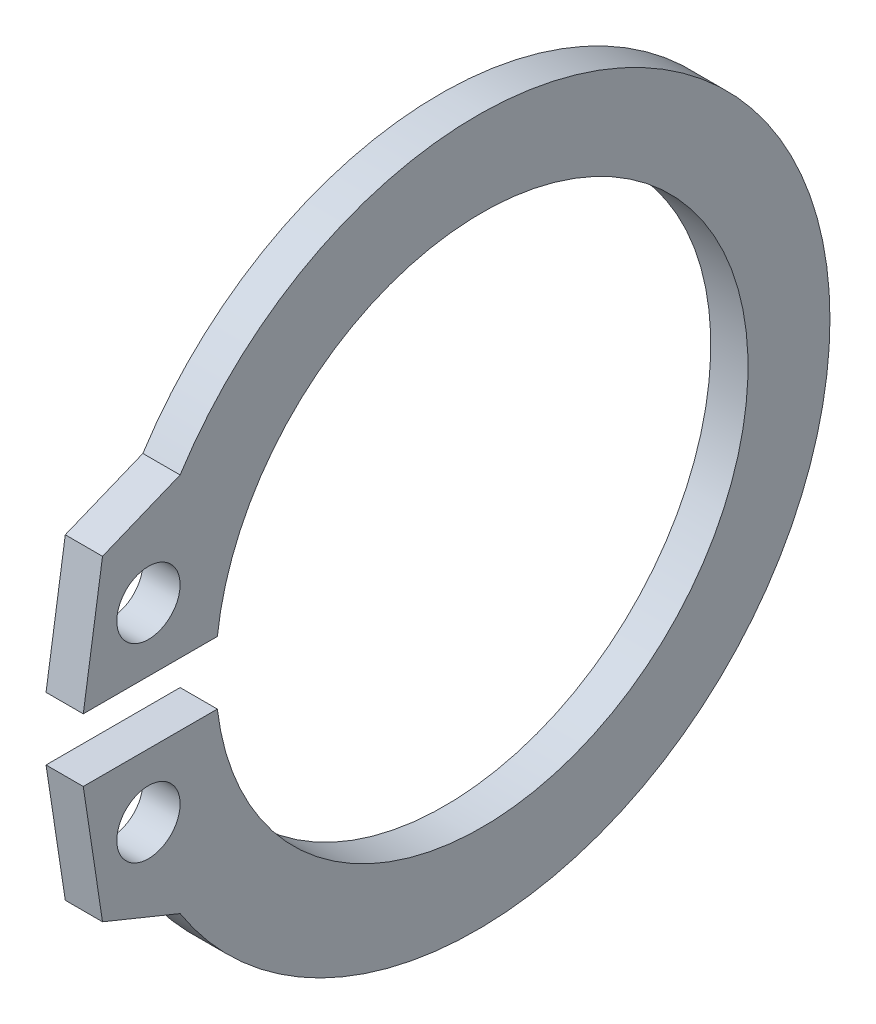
ISO-10303-21;
HEADER;
FILE_DESCRIPTION(('STEP AP214'),'2;1');
FILE_NAME('part.step','',(''),(''),'','','');
FILE_SCHEMA(('AUTOMOTIVE_DESIGN { 1 0 10303 214 1 1 1 1 }'));
ENDSEC;
DATA;
#1=APPLICATION_CONTEXT('core data for automotive mechanical design processes');
#2=APPLICATION_PROTOCOL_DEFINITION('international standard','automotive_design',2000,#1);
#3=PRODUCT_CONTEXT('',#1,'mechanical');
#4=PRODUCT('Part','Part','',(#3));
#5=PRODUCT_RELATED_PRODUCT_CATEGORY('part','',(#4));
#6=PRODUCT_DEFINITION_FORMATION('','',#4);
#7=PRODUCT_DEFINITION_CONTEXT('part definition',#1,'design');
#8=PRODUCT_DEFINITION('design','',#6,#7);
#9=PRODUCT_DEFINITION_SHAPE('','',#8);
#10=(LENGTH_UNIT() NAMED_UNIT(*) SI_UNIT(.MILLI.,.METRE.));
#11=(NAMED_UNIT(*) PLANE_ANGLE_UNIT() SI_UNIT($,.RADIAN.));
#12=(NAMED_UNIT(*) SI_UNIT($,.STERADIAN.) SOLID_ANGLE_UNIT());
#13=UNCERTAINTY_MEASURE_WITH_UNIT(LENGTH_MEASURE(1.E-05),#10,'distance_accuracy_value','');
#14=(GEOMETRIC_REPRESENTATION_CONTEXT(3) GLOBAL_UNCERTAINTY_ASSIGNED_CONTEXT((#13)) GLOBAL_UNIT_ASSIGNED_CONTEXT((#10,
#11,#12)) REPRESENTATION_CONTEXT('',''));
#15=CARTESIAN_POINT('',(0.,0.,0.));
#16=DIRECTION('',(0.,0.,1.));
#17=DIRECTION('',(1.,0.,0.));
#18=AXIS2_PLACEMENT_3D('',#15,#16,#17);
#19=CARTESIAN_POINT('',(8.44999998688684,-70.9500146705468,43.95));
#20=DIRECTION('',(1.,0.,0.));
#21=DIRECTION('',(0.,1.,0.));
#22=AXIS2_PLACEMENT_3D('',#19,#20,#21);
#23=CYLINDRICAL_SURFACE('',#22,0.85);
#24=CARTESIAN_POINT('',(7.94999998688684,-70.9500146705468,43.95));
#25=DIRECTION('',(1.,0.,0.));
#26=DIRECTION('',(0.,1.,0.));
#27=AXIS2_PLACEMENT_3D('',#24,#25,#26);
#28=CIRCLE('',#27,0.85);
#29=CARTESIAN_POINT('',(7.94999998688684,-70.1000146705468,43.95));
#30=VERTEX_POINT('',#29);
#31=EDGE_CURVE('E146',#30,#30,#28,.T.);
#32=ORIENTED_EDGE('',*,*,#31,.F.);
#33=EDGE_LOOP('',(#32));
#34=FACE_BOUND('',#33,.T.);
#35=CARTESIAN_POINT('',(8.94999998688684,-70.9500146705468,43.95));
#36=DIRECTION('',(-1.,0.,0.));
#37=DIRECTION('',(0.,0.,1.));
#38=AXIS2_PLACEMENT_3D('',#35,#36,#37);
#39=CIRCLE('',#38,0.85);
#40=CARTESIAN_POINT('',(8.94999998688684,-70.9500146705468,44.8));
#41=VERTEX_POINT('',#40);
#42=EDGE_CURVE('E153',#41,#41,#39,.T.);
#43=ORIENTED_EDGE('',*,*,#42,.F.);
#44=EDGE_LOOP('',(#43));
#45=FACE_BOUND('',#44,.T.);
#46=ADVANCED_FACE('F15',(#34,#45),#23,.F.);
#47=CARTESIAN_POINT('',(8.44999998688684,-76.0500146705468,43.95));
#48=DIRECTION('',(1.,0.,0.));
#49=DIRECTION('',(0.,1.,0.));
#50=AXIS2_PLACEMENT_3D('',#47,#48,#49);
#51=CYLINDRICAL_SURFACE('',#50,0.85);
#52=CARTESIAN_POINT('',(7.94999998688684,-76.0500146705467,43.95));
#53=DIRECTION('',(1.,0.,0.));
#54=DIRECTION('',(0.,1.,0.));
#55=AXIS2_PLACEMENT_3D('',#52,#53,#54);
#56=CIRCLE('',#55,0.85);
#57=CARTESIAN_POINT('',(7.94999998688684,-75.2000146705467,43.95));
#58=VERTEX_POINT('',#57);
#59=EDGE_CURVE('E144',#58,#58,#56,.T.);
#60=ORIENTED_EDGE('',*,*,#59,.F.);
#61=EDGE_LOOP('',(#60));
#62=FACE_BOUND('',#61,.T.);
#63=CARTESIAN_POINT('',(8.94999998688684,-76.0500146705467,43.95));
#64=DIRECTION('',(-1.,0.,0.));
#65=DIRECTION('',(0.,0.,1.));
#66=AXIS2_PLACEMENT_3D('',#63,#64,#65);
#67=CIRCLE('',#66,0.85);
#68=CARTESIAN_POINT('',(8.94999998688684,-76.0500146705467,44.8));
#69=VERTEX_POINT('',#68);
#70=EDGE_CURVE('E109',#69,#69,#67,.T.);
#71=ORIENTED_EDGE('',*,*,#70,.F.);
#72=EDGE_LOOP('',(#71));
#73=FACE_BOUND('',#72,.T.);
#74=ADVANCED_FACE('F191',(#62,#73),#51,.F.);
#75=CARTESIAN_POINT('',(8.44999998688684,-78.6000146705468,43.1));
#76=DIRECTION('',(0.,-0.92590052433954,0.377767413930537));
#77=DIRECTION('',(0.,-0.377767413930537,-0.92590052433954));
#78=AXIS2_PLACEMENT_3D('',#75,#76,#77);
#79=PLANE('',#78);
#80=DIRECTION('',(0.,0.37776741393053,0.925900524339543));
#81=VECTOR('',#80,1.);
#82=CARTESIAN_POINT('',(7.94999998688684,-78.6000146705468,43.1));
#83=LINE('',#82,#81);
#84=CARTESIAN_POINT('',(7.94999998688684,-78.6000146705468,43.1));
#85=VERTEX_POINT('',#84);
#86=CARTESIAN_POINT('',(7.94999998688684,-77.7500146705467,45.1833333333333));
#87=VERTEX_POINT('',#86);
#88=EDGE_CURVE('E33',#85,#87,#83,.T.);
#89=ORIENTED_EDGE('',*,*,#88,.F.);
#90=DIRECTION('',(-1.,0.,0.));
#91=VECTOR('',#90,1.);
#92=CARTESIAN_POINT('',(8.94999998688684,-78.6000146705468,43.1));
#93=LINE('',#92,#91);
#94=CARTESIAN_POINT('',(8.94999998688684,-78.6000146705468,43.1));
#95=VERTEX_POINT('',#94);
#96=EDGE_CURVE('E98',#95,#85,#93,.T.);
#97=ORIENTED_EDGE('',*,*,#96,.F.);
#98=DIRECTION('',(0.,-0.377767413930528,-0.925900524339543));
#99=VECTOR('',#98,1.);
#100=CARTESIAN_POINT('',(8.94999998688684,-77.7500146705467,45.1833333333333));
#101=LINE('',#100,#99);
#102=CARTESIAN_POINT('',(8.94999998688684,-77.7500146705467,45.1833333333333));
#103=VERTEX_POINT('',#102);
#104=EDGE_CURVE('E103',#103,#95,#101,.T.);
#105=ORIENTED_EDGE('',*,*,#104,.F.);
#106=DIRECTION('',(-1.,0.,0.));
#107=VECTOR('',#106,1.);
#108=CARTESIAN_POINT('',(8.94999998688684,-77.7500146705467,45.1833333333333));
#109=LINE('',#108,#107);
#110=EDGE_CURVE('E9',#103,#87,#109,.T.);
#111=ORIENTED_EDGE('',*,*,#110,.T.);
#112=EDGE_LOOP('',(#89,#97,#105,#111));
#113=FACE_BOUND('',#112,.T.);
#114=ADVANCED_FACE('F162',(#113),#79,.T.);
#115=CARTESIAN_POINT('',(8.44999998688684,-77.7500146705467,45.1833333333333));
#116=DIRECTION('',(0.,-0.149981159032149,0.988688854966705));
#117=DIRECTION('',(0.,-0.988688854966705,-0.149981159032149));
#118=AXIS2_PLACEMENT_3D('',#115,#116,#117);
#119=PLANE('',#118);
#120=DIRECTION('',(0.,0.988688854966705,0.149981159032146));
#121=VECTOR('',#120,1.);
#122=CARTESIAN_POINT('',(7.94999998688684,-77.7500146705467,45.1833333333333));
#123=LINE('',#122,#121);
#124=CARTESIAN_POINT('',(7.94999998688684,-74.3440711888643,45.7000048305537));
#125=VERTEX_POINT('',#124);
#126=EDGE_CURVE('E111',#87,#125,#123,.T.);
#127=ORIENTED_EDGE('',*,*,#126,.F.);
#128=ORIENTED_EDGE('',*,*,#110,.F.);
#129=DIRECTION('',(0.,-0.988688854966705,-0.149981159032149));
#130=VECTOR('',#129,1.);
#131=CARTESIAN_POINT('',(8.94999998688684,-74.3440711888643,45.7000048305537));
#132=LINE('',#131,#130);
#133=CARTESIAN_POINT('',(8.94999998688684,-74.3440711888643,45.7000048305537));
#134=VERTEX_POINT('',#133);
#135=EDGE_CURVE('E108',#134,#103,#132,.T.);
#136=ORIENTED_EDGE('',*,*,#135,.F.);
#137=DIRECTION('',(-1.,0.,0.));
#138=VECTOR('',#137,1.);
#139=CARTESIAN_POINT('',(8.94999998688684,-74.3440711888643,45.7000048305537));
#140=LINE('',#139,#138);
#141=EDGE_CURVE('E25',#134,#125,#140,.T.);
#142=ORIENTED_EDGE('',*,*,#141,.T.);
#143=EDGE_LOOP('',(#127,#128,#136,#142));
#144=FACE_BOUND('',#143,.T.);
#145=ADVANCED_FACE('F164',(#144),#119,.T.);
#146=CARTESIAN_POINT('',(8.44999998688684,-74.3440711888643,42.1000048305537));
#147=DIRECTION('',(0.,1.,0.));
#148=DIRECTION('',(0.,0.,1.));
#149=AXIS2_PLACEMENT_3D('',#146,#147,#148);
#150=PLANE('',#149);
#151=DIRECTION('',(0.,0.,-1.));
#152=VECTOR('',#151,1.);
#153=CARTESIAN_POINT('',(7.94999998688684,-74.3440711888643,45.7000048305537));
#154=LINE('',#153,#152);
#155=CARTESIAN_POINT('',(7.94999998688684,-74.3440711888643,42.1000048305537));
#156=VERTEX_POINT('',#155);
#157=EDGE_CURVE('E113',#125,#156,#154,.T.);
#158=ORIENTED_EDGE('',*,*,#157,.F.);
#159=ORIENTED_EDGE('',*,*,#141,.F.);
#160=DIRECTION('',(0.,0.,1.));
#161=VECTOR('',#160,1.);
#162=CARTESIAN_POINT('',(8.94999998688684,-74.3440711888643,42.1000048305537));
#163=LINE('',#162,#161);
#164=CARTESIAN_POINT('',(8.94999998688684,-74.3440711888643,42.1000048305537));
#165=VERTEX_POINT('',#164);
#166=EDGE_CURVE('E115',#165,#134,#163,.T.);
#167=ORIENTED_EDGE('',*,*,#166,.F.);
#168=DIRECTION('',(-1.,0.,0.));
#169=VECTOR('',#168,1.);
#170=CARTESIAN_POINT('',(8.94999998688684,-74.3440711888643,42.1000048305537));
#171=LINE('',#170,#169);
#172=EDGE_CURVE('E118',#165,#156,#171,.T.);
#173=ORIENTED_EDGE('',*,*,#172,.T.);
#174=EDGE_LOOP('',(#158,#159,#167,#173));
#175=FACE_BOUND('',#174,.T.);
#176=ADVANCED_FACE('F168',(#175),#150,.T.);
#177=CARTESIAN_POINT('',(8.44999998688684,-73.5000146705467,35.));
#178=DIRECTION('',(1.,0.,0.));
#179=DIRECTION('',(0.,1.,0.));
#180=AXIS2_PLACEMENT_3D('',#177,#178,#179);
#181=CYLINDRICAL_SURFACE('',#180,7.15000000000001);
#182=CARTESIAN_POINT('',(7.94999998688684,-73.5000146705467,35.));
#183=DIRECTION('',(1.,0.,0.));
#184=DIRECTION('',(0.,1.,0.));
#185=AXIS2_PLACEMENT_3D('',#182,#183,#184);
#186=CIRCLE('',#185,7.14999999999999);
#187=CARTESIAN_POINT('',(7.94999998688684,-72.6559581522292,42.1000048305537));
#188=VERTEX_POINT('',#187);
#189=EDGE_CURVE('E120',#156,#188,#186,.T.);
#190=ORIENTED_EDGE('',*,*,#189,.F.);
#191=ORIENTED_EDGE('',*,*,#172,.F.);
#192=CARTESIAN_POINT('',(8.94999998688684,-73.5000146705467,35.));
#193=DIRECTION('',(-1.,0.,0.));
#194=DIRECTION('',(0.,0.,1.));
#195=AXIS2_PLACEMENT_3D('',#192,#193,#194);
#196=CIRCLE('',#195,7.14999999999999);
#197=CARTESIAN_POINT('',(8.94999998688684,-72.6559581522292,42.1000048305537));
#198=VERTEX_POINT('',#197);
#199=EDGE_CURVE('E123',#198,#165,#196,.T.);
#200=ORIENTED_EDGE('',*,*,#199,.F.);
#201=DIRECTION('',(-1.,0.,0.));
#202=VECTOR('',#201,1.);
#203=CARTESIAN_POINT('',(8.94999998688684,-72.6559581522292,42.1000048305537));
#204=LINE('',#203,#202);
#205=EDGE_CURVE('E126',#198,#188,#204,.T.);
#206=ORIENTED_EDGE('',*,*,#205,.T.);
#207=EDGE_LOOP('',(#190,#191,#200,#206));
#208=FACE_BOUND('',#207,.T.);
#209=ADVANCED_FACE('F174',(#208),#181,.F.);
#210=CARTESIAN_POINT('',(8.44999998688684,-72.6559581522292,42.1000048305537));
#211=DIRECTION('',(0.,-1.,0.));
#212=DIRECTION('',(0.,0.,-1.));
#213=AXIS2_PLACEMENT_3D('',#210,#211,#212);
#214=PLANE('',#213);
#215=DIRECTION('',(0.,0.,1.));
#216=VECTOR('',#215,1.);
#217=CARTESIAN_POINT('',(7.94999998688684,-72.6559581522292,42.1000048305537));
#218=LINE('',#217,#216);
#219=CARTESIAN_POINT('',(7.94999998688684,-72.6559581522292,45.7000048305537));
#220=VERTEX_POINT('',#219);
#221=EDGE_CURVE('E128',#188,#220,#218,.T.);
#222=ORIENTED_EDGE('',*,*,#221,.F.);
#223=ORIENTED_EDGE('',*,*,#205,.F.);
#224=DIRECTION('',(0.,0.,-1.));
#225=VECTOR('',#224,1.);
#226=CARTESIAN_POINT('',(8.94999998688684,-72.6559581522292,45.7000048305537));
#227=LINE('',#226,#225);
#228=CARTESIAN_POINT('',(8.94999998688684,-72.6559581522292,45.7000048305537));
#229=VERTEX_POINT('',#228);
#230=EDGE_CURVE('E131',#229,#198,#227,.T.);
#231=ORIENTED_EDGE('',*,*,#230,.F.);
#232=DIRECTION('',(-1.,0.,0.));
#233=VECTOR('',#232,1.);
#234=CARTESIAN_POINT('',(8.94999998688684,-72.6559581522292,45.7000048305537));
#235=LINE('',#234,#233);
#236=EDGE_CURVE('E134',#229,#220,#235,.T.);
#237=ORIENTED_EDGE('',*,*,#236,.T.);
#238=EDGE_LOOP('',(#222,#223,#231,#237));
#239=FACE_BOUND('',#238,.T.);
#240=ADVANCED_FACE('F176',(#239),#214,.T.);
#241=CARTESIAN_POINT('',(8.44999998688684,-72.6559581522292,45.7000048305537));
#242=DIRECTION('',(0.,0.149981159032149,0.988688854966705));
#243=DIRECTION('',(0.,-0.988688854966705,0.149981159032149));
#244=AXIS2_PLACEMENT_3D('',#241,#242,#243);
#245=PLANE('',#244);
#246=DIRECTION('',(0.,0.988688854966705,-0.149981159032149));
#247=VECTOR('',#246,1.);
#248=CARTESIAN_POINT('',(7.94999998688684,-72.6559581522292,45.7000048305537));
#249=LINE('',#248,#247);
#250=CARTESIAN_POINT('',(7.94999998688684,-69.2500146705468,45.1833333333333));
#251=VERTEX_POINT('',#250);
#252=EDGE_CURVE('E136',#220,#251,#249,.T.);
#253=ORIENTED_EDGE('',*,*,#252,.F.);
#254=ORIENTED_EDGE('',*,*,#236,.F.);
#255=DIRECTION('',(0.,-0.988688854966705,0.149981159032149));
#256=VECTOR('',#255,1.);
#257=CARTESIAN_POINT('',(8.94999998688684,-69.2500146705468,45.1833333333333));
#258=LINE('',#257,#256);
#259=CARTESIAN_POINT('',(8.94999998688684,-69.2500146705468,45.1833333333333));
#260=VERTEX_POINT('',#259);
#261=EDGE_CURVE('E93',#260,#229,#258,.T.);
#262=ORIENTED_EDGE('',*,*,#261,.F.);
#263=DIRECTION('',(-1.,0.,0.));
#264=VECTOR('',#263,1.);
#265=CARTESIAN_POINT('',(8.94999998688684,-69.2500146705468,45.1833333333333));
#266=LINE('',#265,#264);
#267=EDGE_CURVE('E89',#260,#251,#266,.T.);
#268=ORIENTED_EDGE('',*,*,#267,.T.);
#269=EDGE_LOOP('',(#253,#254,#262,#268));
#270=FACE_BOUND('',#269,.T.);
#271=ADVANCED_FACE('F180',(#270),#245,.T.);
#272=CARTESIAN_POINT('',(8.44999998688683,-68.4000146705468,43.1));
#273=DIRECTION('',(0.,0.925900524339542,0.377767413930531));
#274=DIRECTION('',(0.,-0.377767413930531,0.925900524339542));
#275=AXIS2_PLACEMENT_3D('',#272,#273,#274);
#276=PLANE('',#275);
#277=DIRECTION('',(0.,0.377767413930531,-0.925900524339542));
#278=VECTOR('',#277,1.);
#279=CARTESIAN_POINT('',(7.94999998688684,-69.2500146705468,45.1833333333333));
#280=LINE('',#279,#278);
#281=CARTESIAN_POINT('',(7.94999998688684,-68.4000146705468,43.1));
#282=VERTEX_POINT('',#281);
#283=EDGE_CURVE('E77',#251,#282,#280,.T.);
#284=ORIENTED_EDGE('',*,*,#283,.F.);
#285=ORIENTED_EDGE('',*,*,#267,.F.);
#286=DIRECTION('',(0.,-0.377767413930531,0.925900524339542));
#287=VECTOR('',#286,1.);
#288=CARTESIAN_POINT('',(8.94999998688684,-68.4000146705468,43.1));
#289=LINE('',#288,#287);
#290=CARTESIAN_POINT('',(8.94999998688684,-68.4000146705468,43.1));
#291=VERTEX_POINT('',#290);
#292=EDGE_CURVE('E83',#291,#260,#289,.T.);
#293=ORIENTED_EDGE('',*,*,#292,.F.);
#294=DIRECTION('',(-1.,0.,0.));
#295=VECTOR('',#294,1.);
#296=CARTESIAN_POINT('',(8.94999998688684,-68.4000146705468,43.1));
#297=LINE('',#296,#295);
#298=EDGE_CURVE('E86',#291,#282,#297,.T.);
#299=ORIENTED_EDGE('',*,*,#298,.T.);
#300=EDGE_LOOP('',(#284,#285,#293,#299));
#301=FACE_BOUND('',#300,.T.);
#302=ADVANCED_FACE('F85',(#301),#276,.T.);
#303=CARTESIAN_POINT('',(8.44999998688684,-73.5000146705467,35.1202722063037));
#304=DIRECTION('',(1.,0.,0.));
#305=DIRECTION('',(0.,1.,0.));
#306=AXIS2_PLACEMENT_3D('',#303,#304,#305);
#307=CYLINDRICAL_SURFACE('',#306,9.47027220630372);
#308=CARTESIAN_POINT('',(7.94999998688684,-73.5000146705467,35.1202722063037));
#309=DIRECTION('',(-1.,0.,0.));
#310=DIRECTION('',(0.,0.,1.));
#311=AXIS2_PLACEMENT_3D('',#308,#309,#310);
#312=CIRCLE('',#311,9.47027220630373);
#313=EDGE_CURVE('E97',#282,#85,#312,.T.);
#314=ORIENTED_EDGE('',*,*,#313,.F.);
#315=ORIENTED_EDGE('',*,*,#298,.F.);
#316=CARTESIAN_POINT('',(8.94999998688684,-73.5000146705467,35.1202722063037));
#317=DIRECTION('',(1.,0.,0.));
#318=DIRECTION('',(0.,1.,0.));
#319=AXIS2_PLACEMENT_3D('',#316,#317,#318);
#320=CIRCLE('',#319,9.47027220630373);
#321=EDGE_CURVE('E19',#95,#291,#320,.T.);
#322=ORIENTED_EDGE('',*,*,#321,.F.);
#323=ORIENTED_EDGE('',*,*,#96,.T.);
#324=EDGE_LOOP('',(#314,#315,#322,#323));
#325=FACE_BOUND('',#324,.T.);
#326=ADVANCED_FACE('F17',(#325),#307,.T.);
#327=CARTESIAN_POINT('',(8.94999998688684,-73.5000146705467,25.65));
#328=DIRECTION('',(-1.,0.,0.));
#329=DIRECTION('',(0.,-1.,0.));
#330=AXIS2_PLACEMENT_3D('',#327,#328,#329);
#331=PLANE('',#330);
#332=ORIENTED_EDGE('',*,*,#321,.T.);
#333=ORIENTED_EDGE('',*,*,#292,.T.);
#334=ORIENTED_EDGE('',*,*,#261,.T.);
#335=ORIENTED_EDGE('',*,*,#230,.T.);
#336=ORIENTED_EDGE('',*,*,#199,.T.);
#337=ORIENTED_EDGE('',*,*,#166,.T.);
#338=ORIENTED_EDGE('',*,*,#135,.T.);
#339=ORIENTED_EDGE('',*,*,#104,.T.);
#340=EDGE_LOOP('',(#332,#333,#334,#335,#336,#337,#338,#339));
#341=FACE_BOUND('',#340,.T.);
#342=ORIENTED_EDGE('',*,*,#70,.T.);
#343=EDGE_LOOP('',(#342));
#344=FACE_BOUND('',#343,.T.);
#345=ORIENTED_EDGE('',*,*,#42,.T.);
#346=EDGE_LOOP('',(#345));
#347=FACE_BOUND('',#346,.T.);
#348=ADVANCED_FACE('F100',(#341,#344,#347),#331,.F.);
#349=CARTESIAN_POINT('',(7.94999998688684,-73.5000146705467,25.65));
#350=DIRECTION('',(-1.,0.,0.));
#351=DIRECTION('',(0.,-1.,0.));
#352=AXIS2_PLACEMENT_3D('',#349,#350,#351);
#353=PLANE('',#352);
#354=ORIENTED_EDGE('',*,*,#88,.T.);
#355=ORIENTED_EDGE('',*,*,#126,.T.);
#356=ORIENTED_EDGE('',*,*,#157,.T.);
#357=ORIENTED_EDGE('',*,*,#189,.T.);
#358=ORIENTED_EDGE('',*,*,#221,.T.);
#359=ORIENTED_EDGE('',*,*,#252,.T.);
#360=ORIENTED_EDGE('',*,*,#283,.T.);
#361=ORIENTED_EDGE('',*,*,#313,.T.);
#362=EDGE_LOOP('',(#354,#355,#356,#357,#358,#359,#360,#361));
#363=FACE_BOUND('',#362,.T.);
#364=ORIENTED_EDGE('',*,*,#59,.T.);
#365=EDGE_LOOP('',(#364));
#366=FACE_BOUND('',#365,.T.);
#367=ORIENTED_EDGE('',*,*,#31,.T.);
#368=EDGE_LOOP('',(#367));
#369=FACE_BOUND('',#368,.T.);
#370=ADVANCED_FACE('F159',(#363,#366,#369),#353,.T.);
#371=CLOSED_SHELL('',(#46,#74,#114,#145,#176,#209,#240,#271,#302,#326,#348,#370));
#372=MANIFOLD_SOLID_BREP('B1',#371);
#373=ADVANCED_BREP_SHAPE_REPRESENTATION('',(#18,#372),#14);
#374=SHAPE_DEFINITION_REPRESENTATION(#9,#373);
ENDSEC;
END-ISO-10303-21;
